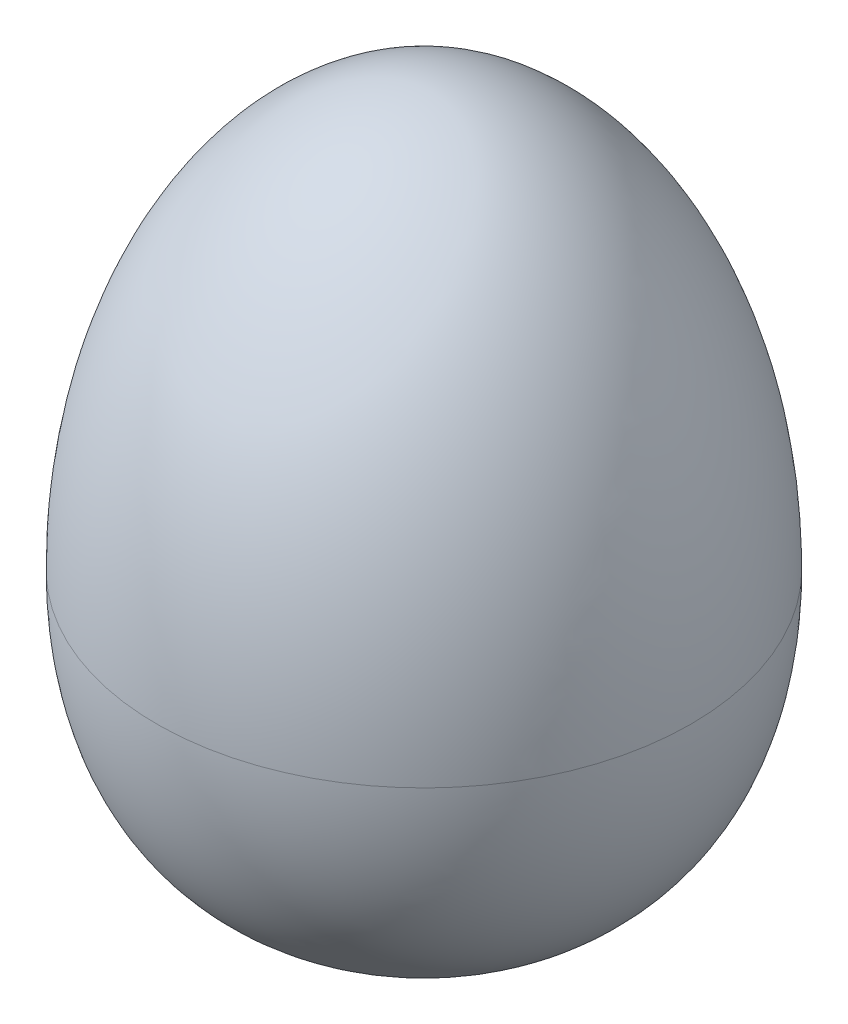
ISO-10303-21;
HEADER;
FILE_DESCRIPTION(('STEP AP214'),'2;1');
FILE_NAME('part.step','',(''),(''),'','','');
FILE_SCHEMA(('AUTOMOTIVE_DESIGN { 1 0 10303 214 1 1 1 1 }'));
ENDSEC;
DATA;
#1=APPLICATION_CONTEXT('core data for automotive mechanical design processes');
#2=APPLICATION_PROTOCOL_DEFINITION('international standard','automotive_design',2000,#1);
#3=PRODUCT_CONTEXT('',#1,'mechanical');
#4=PRODUCT('Part','Part','',(#3));
#5=PRODUCT_RELATED_PRODUCT_CATEGORY('part','',(#4));
#6=PRODUCT_DEFINITION_FORMATION('','',#4);
#7=PRODUCT_DEFINITION_CONTEXT('part definition',#1,'design');
#8=PRODUCT_DEFINITION('design','',#6,#7);
#9=PRODUCT_DEFINITION_SHAPE('','',#8);
#10=(LENGTH_UNIT() NAMED_UNIT(*) SI_UNIT(.MILLI.,.METRE.));
#11=(NAMED_UNIT(*) PLANE_ANGLE_UNIT() SI_UNIT($,.RADIAN.));
#12=(NAMED_UNIT(*) SI_UNIT($,.STERADIAN.) SOLID_ANGLE_UNIT());
#13=UNCERTAINTY_MEASURE_WITH_UNIT(LENGTH_MEASURE(1.E-05),#10,'distance_accuracy_value','');
#14=(GEOMETRIC_REPRESENTATION_CONTEXT(3) GLOBAL_UNCERTAINTY_ASSIGNED_CONTEXT((#13)) GLOBAL_UNIT_ASSIGNED_CONTEXT((#10,
#11,#12)) REPRESENTATION_CONTEXT('',''));
#15=CARTESIAN_POINT('',(0.,0.,0.));
#16=DIRECTION('',(0.,0.,1.));
#17=DIRECTION('',(1.,0.,0.));
#18=AXIS2_PLACEMENT_3D('',#15,#16,#17);
#19=CARTESIAN_POINT('',(17.25,20.0000000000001,0.));
#20=CARTESIAN_POINT('',(17.25,35.5532377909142,0.));
#21=CARTESIAN_POINT('',(8.74639240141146,46.75,0.));
#22=CARTESIAN_POINT('',(0.,46.75,0.));
#23=B_SPLINE_CURVE_WITH_KNOTS('',3,(#19,#20,#21,#22),.UNSPECIFIED.,.F.,.F.,(4,4),(0.,1.),.UNSPECIFIED.);
#24=CARTESIAN_POINT('',(0.,1.75,0.));
#25=DIRECTION('',(0.,-1.,0.));
#26=AXIS1_PLACEMENT('',#24,#25);
#27=SURFACE_OF_REVOLUTION('',#23,#26);
#28=CARTESIAN_POINT('',(0.,46.75,0.));
#29=VERTEX_POINT('',#28);
#30=VERTEX_LOOP('',#29);
#31=FACE_BOUND('',#30,.T.);
#32=CARTESIAN_POINT('',(0.,20.,0.));
#33=DIRECTION('',(0.,-1.,0.));
#34=DIRECTION('',(1.,0.,0.));
#35=AXIS2_PLACEMENT_3D('',#32,#33,#34);
#36=CIRCLE('',#35,17.25);
#37=CARTESIAN_POINT('',(17.25,20.,0.));
#38=VERTEX_POINT('',#37);
#39=EDGE_CURVE('E11',#38,#38,#36,.T.);
#40=ORIENTED_EDGE('',*,*,#39,.F.);
#41=EDGE_LOOP('',(#40));
#42=FACE_BOUND('',#41,.T.);
#43=ADVANCED_FACE('F34',(#31,#42),#27,.F.);
#44=CARTESIAN_POINT('',(0.,1.75,0.));
#45=CARTESIAN_POINT('',(1.64901196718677,1.75,0.));
#46=CARTESIAN_POINT('',(3.14637739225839,1.89448312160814,0.));
#47=CARTESIAN_POINT('',(5.86050955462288,2.42439524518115,0.));
#48=CARTESIAN_POINT('',(7.07732260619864,2.80947778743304,0.));
#49=CARTESIAN_POINT('',(9.26371495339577,3.77780989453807,0.));
#50=CARTESIAN_POINT('',(10.2337725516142,4.36094977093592,0.));
#51=CARTESIAN_POINT('',(11.9633088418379,5.69710449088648,0.));
#52=CARTESIAN_POINT('',(12.723112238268,6.45054116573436,0.));
#53=CARTESIAN_POINT('',(14.057247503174,8.10893483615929,0.));
#54=CARTESIAN_POINT('',(14.6313740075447,9.01423491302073,0.));
#55=CARTESIAN_POINT('',(15.605565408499,10.9538596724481,0.));
#56=CARTESIAN_POINT('',(16.0053531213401,11.98816103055,0.));
#57=CARTESIAN_POINT('',(16.9538705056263,15.2369926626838,0.));
#58=CARTESIAN_POINT('',(17.25,17.5981857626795,0.));
#59=CARTESIAN_POINT('',(17.25,20.,0.));
#60=B_SPLINE_CURVE_WITH_KNOTS('',3,(#44,#45,#46,#47,#48,#49,#50,#51,#52,#53,#54,#55,#56,#57,#58,
#59),.UNSPECIFIED.,.F.,.F.,(4,2,2,2,2,2,2,4),(0.,0.125,0.25,0.375,0.5,0.625,0.75,1.),.UNSPECIFIED.);
#61=CARTESIAN_POINT('',(0.,1.75,0.));
#62=DIRECTION('',(0.,-1.,0.));
#63=AXIS1_PLACEMENT('',#61,#62);
#64=SURFACE_OF_REVOLUTION('',#60,#63);
#65=ORIENTED_EDGE('',*,*,#39,.T.);
#66=EDGE_LOOP('',(#65));
#67=FACE_BOUND('',#66,.T.);
#68=CARTESIAN_POINT('',(0.,1.75,0.));
#69=VERTEX_POINT('',#68);
#70=VERTEX_LOOP('',#69);
#71=FACE_BOUND('',#70,.T.);
#72=ADVANCED_FACE('F49',(#67,#71),#64,.F.);
#73=CLOSED_SHELL('',(#43,#72));
#74=MANIFOLD_SOLID_BREP('B2',#73);
#75=ADVANCED_BREP_SHAPE_REPRESENTATION('',(#18,#74),#14);
#76=SHAPE_DEFINITION_REPRESENTATION(#9,#75);
ENDSEC;
END-ISO-10303-21;
